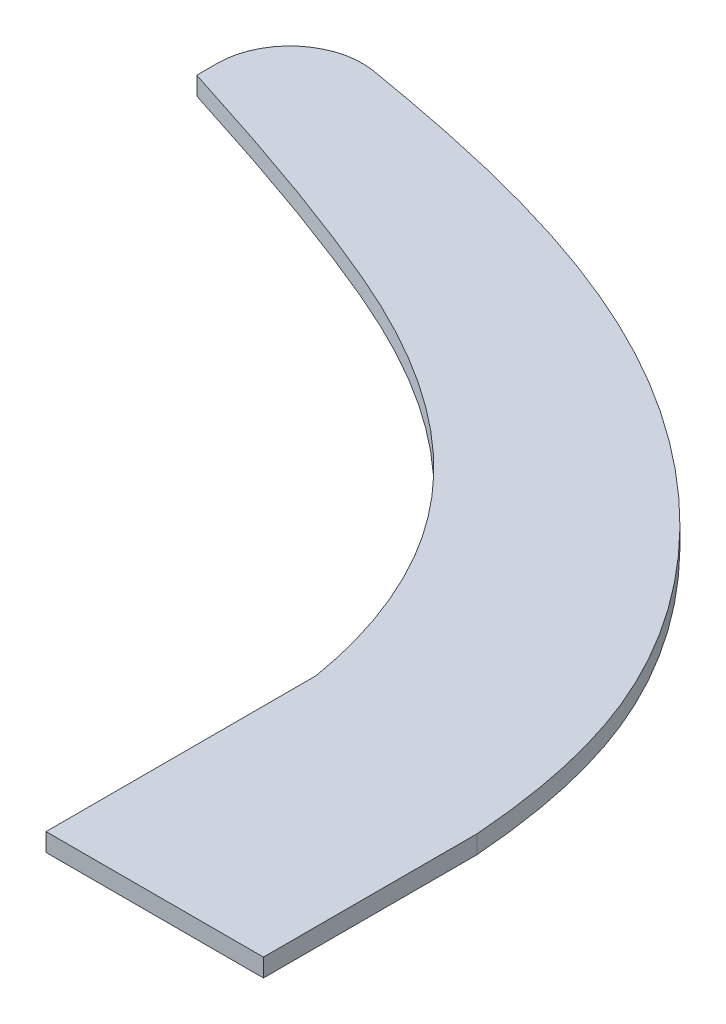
from build123d import *

# Parameters (mm, degrees)
EXTRUDE1_DEPTH = 6.35


with BuildPart() as part:
    # Sketch1 → Extrude1 (new body)
    with BuildSketch(Plane(origin=(0, 0, 0), x_dir=(1, 0, 0), z_dir=(0, 1, 0))):
        with BuildLine():
            Line((3.319787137, 48.26), (-72.880212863, 48.26))
            Line((-72.880212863, 48.26), (-72.880212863, 142.977188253))
            add(Edge.make_bspline(
                [(-72.880212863, 142.977188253), (-75.089486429, 155.984810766), (-80.162520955, 174.044765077), (-106.217359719, 225.42420478), (-147.777683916, 255.872844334), (-215.313087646, 284.497873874), (-249.397028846, 295.816675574), (-276.080212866, 304.304256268)],
                knots=[0.204924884, 0.204924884, 0.204924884, 0.204924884, 0.2910447, 0.329596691, 0.561461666, 0.611079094, 0.796787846, 0.796787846, 0.796787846, 0.796787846], degree=3))
            Line((-276.080212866, 304.304256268), (-276.080212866, 311.525639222))
            ThreePointArc((-276.080212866, 311.525639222), (-267.0780752, 330.923322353), (-246.452645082, 336.571350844))
            add(Edge.make_bspline(
                [(3.319787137, 123.182472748), (1.729959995, 144.350911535), (-10.637747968, 212.558405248), (-101.308396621, 305.399197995), (-196.449017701, 328.131034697), (-246.452645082, 336.571350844)],
                knots=[0.156420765, 0.156420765, 0.156420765, 0.156420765, 0.291931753, 0.5959683, 0.916312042, 0.916312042, 0.916312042, 0.916312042], degree=3))
            Line((3.319787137, 123.182472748), (3.319787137, 48.26))
        make_face()
    extrude(amount=EXTRUDE1_DEPTH)


solid = part.part
